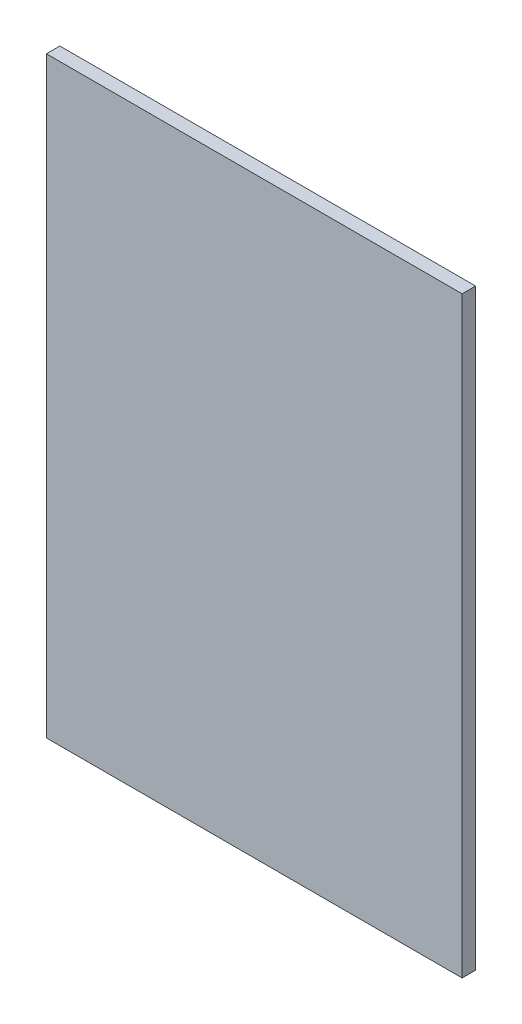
from build123d import *

# Parameters (mm, degrees)
CROQUIS1_W              = 617.5
CROQUIS1_H              = 880
SALIENTE_EXTRUIR1_DEPTH = 20


with BuildPart() as part:
    # Croquis1 → Saliente-Extruir1 (new body)
    with BuildSketch(Plane.XY):
        with Locations((-14.542572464, -212.912137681)):
            Rectangle(CROQUIS1_W, CROQUIS1_H)
    extrude(amount=SALIENTE_EXTRUIR1_DEPTH)


solid = part.part
